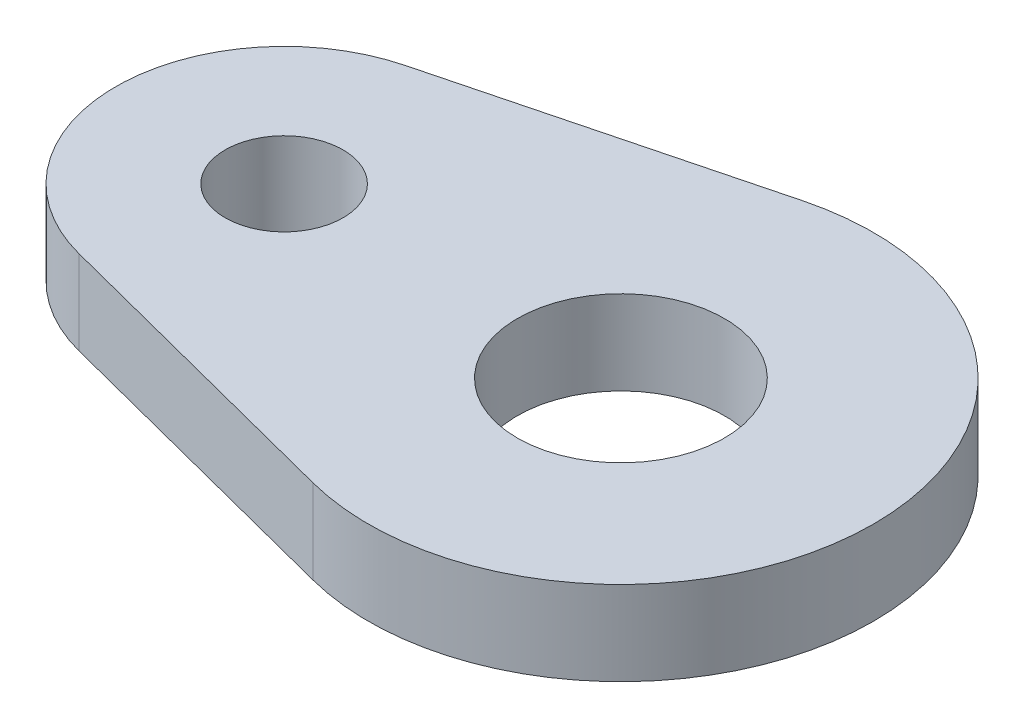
from build123d import *

# Parameters (mm, degrees)
ESQUISSE1_R        = 6.15
ESQUISSE1_R_2      = 3.5
BOSS_EXTRU_1_DEPTH = 5


with BuildPart() as part:
    # Esquisse1 → Boss.-Extru.1 (new body)
    with BuildSketch(Plane.XZ.offset(5)):
        with BuildLine():
            Line((-22.5, -9.682458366), (-3.75, -14.523687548))
            ThreePointArc((-3.75, -14.523687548), (15, 0), (-3.75, 14.523687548))
            Line((-3.75, 14.523687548), (-22.5, 9.682458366))
            ThreePointArc((-22.5, 9.682458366), (-30, 0), (-22.5, -9.682458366))
        make_face()
        with Locations(Location((0, 0, 0), (0, 0, 90))):
            Circle(ESQUISSE1_R, mode=Mode.SUBTRACT)
        with Locations(Location((-20, 0, 0), (0, 0, 90))):
            Circle(ESQUISSE1_R_2, mode=Mode.SUBTRACT)
    extrude(amount=-BOSS_EXTRU_1_DEPTH)


solid = part.part
